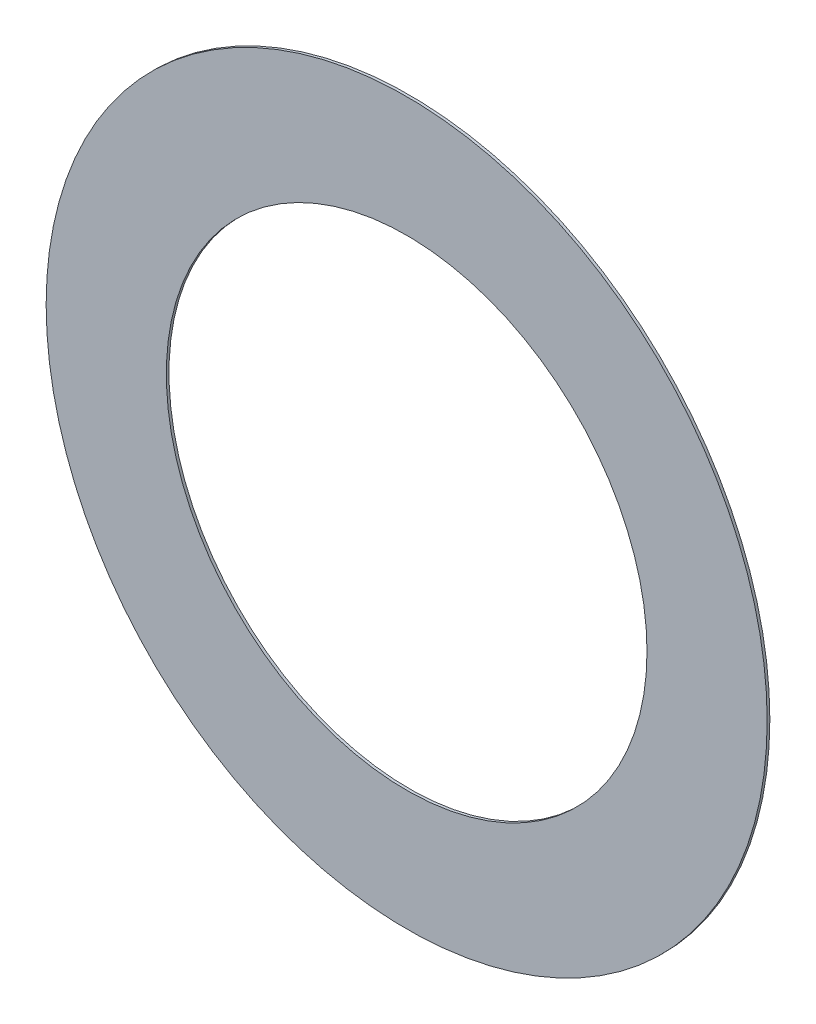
from build123d import *

# Parameters (mm, degrees)
SKETCH2_R           = 6.75
SKETCH2_R_2         = 4.5
BOSS_EXTRUDE1_DEPTH = 0.05


with BuildPart() as part:
    # Sketch2 → Boss-Extrude1 (new body)
    with BuildSketch(Plane.XY):
        Circle(SKETCH2_R)
        Circle(SKETCH2_R_2, mode=Mode.SUBTRACT)
    extrude(amount=BOSS_EXTRUDE1_DEPTH)


solid = part.part
